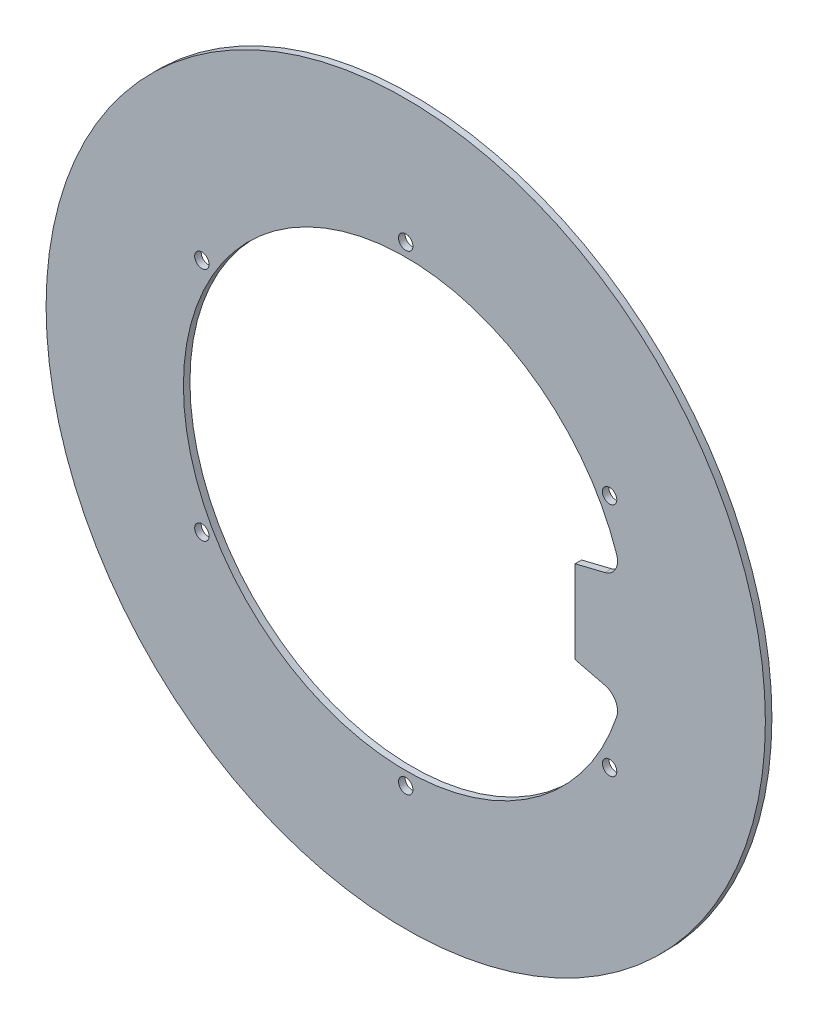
from build123d import *

# Parameters (mm, degrees)
SKETCH1_R           = 55
SKETCH1_R_2         = 1.1
BOSS_EXTRUDE1_DEPTH = 1


with BuildPart() as part:
    # Sketch1 → Boss-Extrude1 (new body)
    with BuildSketch(Plane.XY):
        Circle(SKETCH1_R)
        with Locations((0, 36)):
            Circle(SKETCH1_R_2, mode=Mode.SUBTRACT)
        with Locations((31.176914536, 18)):
            Circle(SKETCH1_R_2, mode=Mode.SUBTRACT)
        with Locations((31.176914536, -18)):
            Circle(SKETCH1_R_2, mode=Mode.SUBTRACT)
        with Locations((0, -36)):
            Circle(SKETCH1_R_2, mode=Mode.SUBTRACT)
        with Locations((-31.176914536, -18)):
            Circle(SKETCH1_R_2, mode=Mode.SUBTRACT)
        with Locations((-31.176914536, 18)):
            Circle(SKETCH1_R_2, mode=Mode.SUBTRACT)
        with BuildLine():
            Line((25.908, -6.35), (30.455848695, -7.464668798))
            ThreePointArc((30.455848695, -7.464668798), (32.074599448, -8.703611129), (32.261305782, -10.733505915))
            ThreePointArc((32.261305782, -10.733505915), (-34, 0), (32.261305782, 10.733505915))
            ThreePointArc((32.261305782, 10.733505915), (32.074599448, 8.703611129), (30.455848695, 7.464668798))
            Line((30.455848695, 7.464668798), (25.908, 6.35))
            Line((25.908, 6.35), (25.908, -6.35))
        make_face(mode=Mode.SUBTRACT)
    extrude(amount=BOSS_EXTRUDE1_DEPTH)


solid = part.part
